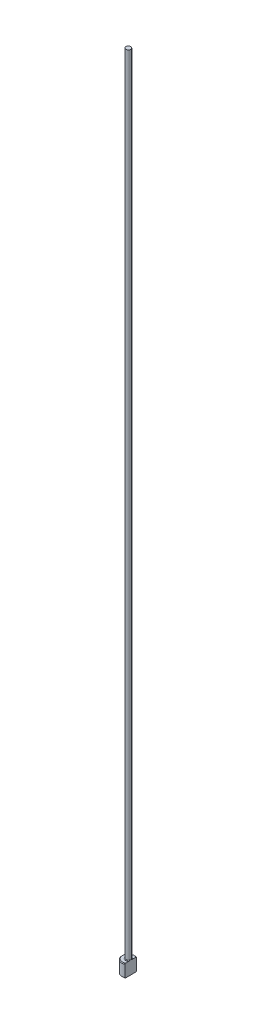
from build123d import *
from build123d.topology import SkipClean

# Parameters (mm, degrees)
CHAMFER1_SIZE    = 0.2
FILLET1_R        = 0.2
KEYED_HEAD_DEPTH = 251.015999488


with BuildPart() as part:
    # Sketch1 → Revolve1 (revolve)
    with BuildSketch(Plane.XY, mode=Mode.PRIVATE) as revolve1_sk:
        Polygon((0, 0), (-2, 0), (-2, 4), (-0.75, 4), (-0.75, 250), (0, 250), align=None)
    revolve(revolve1_sk.sketch.rotate(Axis((0, 259.958771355, 0), (0, -1, 0)), 270), axis=Axis((0, 259.958771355, 0), (0, -1, 0)))

    # Chamfer1
    chamfer1_edges = [part.edges().sort_by_distance(p)[0] for p in [
        (0, 4, -2),
        (0, 0, -2),
    ]]
    chamfer(chamfer1_edges, length=CHAMFER1_SIZE)

    # Fillet1
    fillet1_edges = [part.edges().sort_by_distance(p)[0] for p in [
        (0, 4, -0.75),
    ]]
    fillet(fillet1_edges, radius=FILLET1_R)

    # Sketch2 → KEYED HEAD (cut, through all)
    with SkipClean():  # the faces are left unmerged after this step: merging them gives an invalid solid
        with BuildSketch(Plane(origin=(0, 0, 0), x_dir=(1, 0, 0), z_dir=(0, 1, 0))):
            with BuildLine():
                Line((0.75, -1.854049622), (0.75, 1.854049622))
                ThreePointArc((0.75, 1.854049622), (2, 0), (0.75, -1.854049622))
            make_face()
        extrude(amount=KEYED_HEAD_DEPTH, mode=Mode.SUBTRACT)


solid = part.part
